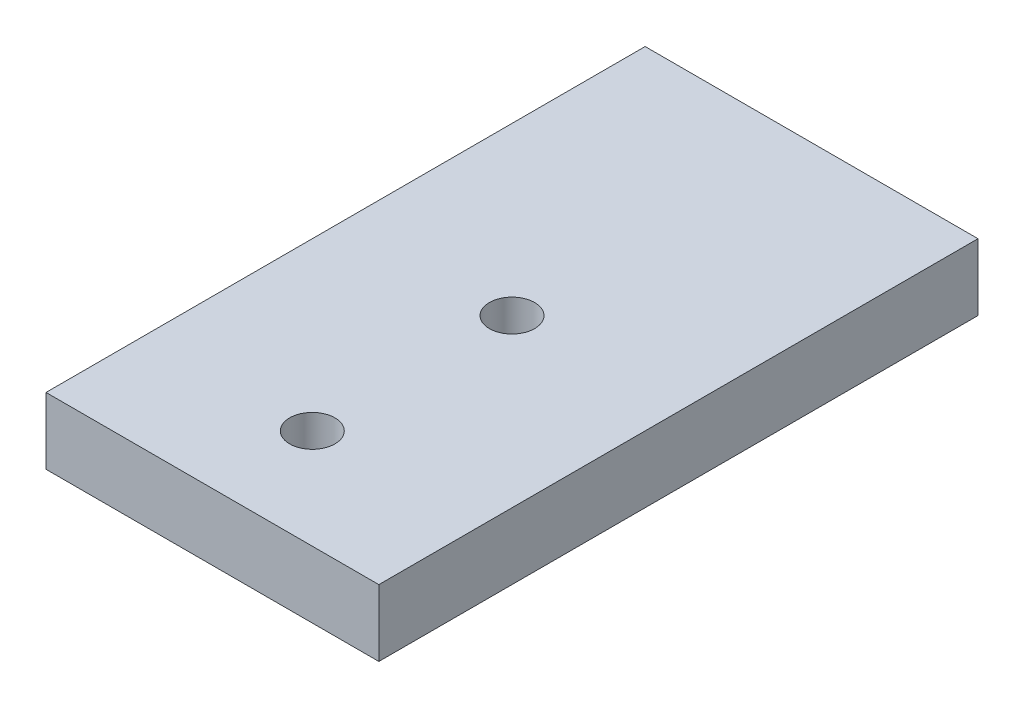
ISO-10303-21;
HEADER;
FILE_DESCRIPTION(('STEP AP214'),'2;1');
FILE_NAME('part.step','',(''),(''),'','','');
FILE_SCHEMA(('AUTOMOTIVE_DESIGN { 1 0 10303 214 1 1 1 1 }'));
ENDSEC;
DATA;
#1=APPLICATION_CONTEXT('core data for automotive mechanical design processes');
#2=APPLICATION_PROTOCOL_DEFINITION('international standard','automotive_design',2000,#1);
#3=PRODUCT_CONTEXT('',#1,'mechanical');
#4=PRODUCT('Part','Part','',(#3));
#5=PRODUCT_RELATED_PRODUCT_CATEGORY('part','',(#4));
#6=PRODUCT_DEFINITION_FORMATION('','',#4);
#7=PRODUCT_DEFINITION_CONTEXT('part definition',#1,'design');
#8=PRODUCT_DEFINITION('design','',#6,#7);
#9=PRODUCT_DEFINITION_SHAPE('','',#8);
#10=(LENGTH_UNIT() NAMED_UNIT(*) SI_UNIT(.MILLI.,.METRE.));
#11=(NAMED_UNIT(*) PLANE_ANGLE_UNIT() SI_UNIT($,.RADIAN.));
#12=(NAMED_UNIT(*) SI_UNIT($,.STERADIAN.) SOLID_ANGLE_UNIT());
#13=UNCERTAINTY_MEASURE_WITH_UNIT(LENGTH_MEASURE(1.E-05),#10,'distance_accuracy_value','');
#14=(GEOMETRIC_REPRESENTATION_CONTEXT(3) GLOBAL_UNCERTAINTY_ASSIGNED_CONTEXT((#13)) GLOBAL_UNIT_ASSIGNED_CONTEXT((#10,
#11,#12)) REPRESENTATION_CONTEXT('',''));
#15=CARTESIAN_POINT('',(0.,0.,0.));
#16=DIRECTION('',(0.,0.,1.));
#17=DIRECTION('',(1.,0.,0.));
#18=AXIS2_PLACEMENT_3D('',#15,#16,#17);
#19=CARTESIAN_POINT('',(0.,10.,45.));
#20=DIRECTION('',(1.,0.,0.));
#21=DIRECTION('',(0.,1.,0.));
#22=AXIS2_PLACEMENT_3D('',#19,#20,#21);
#23=PLANE('',#22);
#24=DIRECTION('',(0.,-1.,0.));
#25=VECTOR('',#24,1.);
#26=CARTESIAN_POINT('',(0.,10.,-45.));
#27=LINE('',#26,#25);
#28=CARTESIAN_POINT('',(0.,10.,-45.));
#29=VERTEX_POINT('',#28);
#30=CARTESIAN_POINT('',(0.,0.,-45.));
#31=VERTEX_POINT('',#30);
#32=EDGE_CURVE('E88',#29,#31,#27,.T.);
#33=ORIENTED_EDGE('',*,*,#32,.T.);
#34=DIRECTION('',(0.,0.,-1.));
#35=VECTOR('',#34,1.);
#36=CARTESIAN_POINT('',(0.,0.,45.));
#37=LINE('',#36,#35);
#38=CARTESIAN_POINT('',(0.,0.,45.));
#39=VERTEX_POINT('',#38);
#40=EDGE_CURVE('E11',#39,#31,#37,.T.);
#41=ORIENTED_EDGE('',*,*,#40,.F.);
#42=DIRECTION('',(0.,-1.,0.));
#43=VECTOR('',#42,1.);
#44=CARTESIAN_POINT('',(0.,10.,45.));
#45=LINE('',#44,#43);
#46=CARTESIAN_POINT('',(0.,10.,45.));
#47=VERTEX_POINT('',#46);
#48=EDGE_CURVE('E117',#47,#39,#45,.T.);
#49=ORIENTED_EDGE('',*,*,#48,.F.);
#50=DIRECTION('',(0.,0.,-1.));
#51=VECTOR('',#50,1.);
#52=CARTESIAN_POINT('',(0.,10.,45.));
#53=LINE('',#52,#51);
#54=EDGE_CURVE('E101',#47,#29,#53,.T.);
#55=ORIENTED_EDGE('',*,*,#54,.T.);
#56=EDGE_LOOP('',(#33,#41,#49,#55));
#57=FACE_BOUND('',#56,.T.);
#58=ADVANCED_FACE('F42',(#57),#23,.F.);
#59=CARTESIAN_POINT('',(0.,0.,45.));
#60=DIRECTION('',(0.,1.,0.));
#61=DIRECTION('',(0.,0.,1.));
#62=AXIS2_PLACEMENT_3D('',#59,#60,#61);
#63=PLANE('',#62);
#64=CARTESIAN_POINT('',(25.,0.,30.));
#65=DIRECTION('',(0.,1.,0.));
#66=DIRECTION('',(0.,0.,1.));
#67=AXIS2_PLACEMENT_3D('',#64,#65,#66);
#68=CIRCLE('',#67,3.39999999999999);
#69=CARTESIAN_POINT('',(25.,0.,33.4));
#70=VERTEX_POINT('',#69);
#71=EDGE_CURVE('E158',#70,#70,#68,.T.);
#72=ORIENTED_EDGE('',*,*,#71,.T.);
#73=EDGE_LOOP('',(#72));
#74=FACE_BOUND('',#73,.T.);
#75=CARTESIAN_POINT('',(25.,0.,0.));
#76=DIRECTION('',(0.,1.,0.));
#77=DIRECTION('',(0.,0.,1.));
#78=AXIS2_PLACEMENT_3D('',#75,#76,#77);
#79=CIRCLE('',#78,3.39999999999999);
#80=CARTESIAN_POINT('',(25.,0.,3.39999999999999));
#81=VERTEX_POINT('',#80);
#82=EDGE_CURVE('E45',#81,#81,#79,.T.);
#83=ORIENTED_EDGE('',*,*,#82,.T.);
#84=EDGE_LOOP('',(#83));
#85=FACE_BOUND('',#84,.T.);
#86=DIRECTION('',(1.,0.,0.));
#87=VECTOR('',#86,1.);
#88=CARTESIAN_POINT('',(0.,0.,-45.));
#89=LINE('',#88,#87);
#90=CARTESIAN_POINT('',(50.,0.,-45.));
#91=VERTEX_POINT('',#90);
#92=EDGE_CURVE('E84',#31,#91,#89,.T.);
#93=ORIENTED_EDGE('',*,*,#92,.T.);
#94=DIRECTION('',(0.,0.,-1.));
#95=VECTOR('',#94,1.);
#96=CARTESIAN_POINT('',(50.,0.,45.));
#97=LINE('',#96,#95);
#98=CARTESIAN_POINT('',(50.,0.,45.));
#99=VERTEX_POINT('',#98);
#100=EDGE_CURVE('E51',#99,#91,#97,.T.);
#101=ORIENTED_EDGE('',*,*,#100,.F.);
#102=DIRECTION('',(1.,0.,0.));
#103=VECTOR('',#102,1.);
#104=CARTESIAN_POINT('',(0.,0.,45.));
#105=LINE('',#104,#103);
#106=EDGE_CURVE('E97',#39,#99,#105,.T.);
#107=ORIENTED_EDGE('',*,*,#106,.F.);
#108=ORIENTED_EDGE('',*,*,#40,.T.);
#109=EDGE_LOOP('',(#93,#101,#107,#108));
#110=FACE_BOUND('',#109,.T.);
#111=ADVANCED_FACE('F96',(#74,#85,#110),#63,.F.);
#112=CARTESIAN_POINT('',(50.,10.,45.));
#113=DIRECTION('',(-1.,0.,0.));
#114=DIRECTION('',(0.,0.,1.));
#115=AXIS2_PLACEMENT_3D('',#112,#113,#114);
#116=PLANE('',#115);
#117=DIRECTION('',(0.,1.,0.));
#118=VECTOR('',#117,1.);
#119=CARTESIAN_POINT('',(50.,10.,-45.));
#120=LINE('',#119,#118);
#121=CARTESIAN_POINT('',(50.,10.,-45.));
#122=VERTEX_POINT('',#121);
#123=EDGE_CURVE('E89',#91,#122,#120,.T.);
#124=ORIENTED_EDGE('',*,*,#123,.T.);
#125=DIRECTION('',(0.,0.,-1.));
#126=VECTOR('',#125,1.);
#127=CARTESIAN_POINT('',(50.,10.,45.));
#128=LINE('',#127,#126);
#129=CARTESIAN_POINT('',(50.,10.,45.));
#130=VERTEX_POINT('',#129);
#131=EDGE_CURVE('E127',#130,#122,#128,.T.);
#132=ORIENTED_EDGE('',*,*,#131,.F.);
#133=DIRECTION('',(0.,1.,0.));
#134=VECTOR('',#133,1.);
#135=CARTESIAN_POINT('',(50.,10.,45.));
#136=LINE('',#135,#134);
#137=EDGE_CURVE('E63',#99,#130,#136,.T.);
#138=ORIENTED_EDGE('',*,*,#137,.F.);
#139=ORIENTED_EDGE('',*,*,#100,.T.);
#140=EDGE_LOOP('',(#124,#132,#138,#139));
#141=FACE_BOUND('',#140,.T.);
#142=ADVANCED_FACE('F132',(#141),#116,.F.);
#143=CARTESIAN_POINT('',(0.,10.,45.));
#144=DIRECTION('',(0.,-1.,0.));
#145=DIRECTION('',(0.,0.,-1.));
#146=AXIS2_PLACEMENT_3D('',#143,#144,#145);
#147=PLANE('',#146);
#148=CARTESIAN_POINT('',(25.,10.,30.));
#149=DIRECTION('',(0.,1.,0.));
#150=DIRECTION('',(0.,0.,1.));
#151=AXIS2_PLACEMENT_3D('',#148,#149,#150);
#152=CIRCLE('',#151,3.39999999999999);
#153=CARTESIAN_POINT('',(25.,10.,33.4));
#154=VERTEX_POINT('',#153);
#155=EDGE_CURVE('E175',#154,#154,#152,.T.);
#156=ORIENTED_EDGE('',*,*,#155,.F.);
#157=EDGE_LOOP('',(#156));
#158=FACE_BOUND('',#157,.T.);
#159=CARTESIAN_POINT('',(25.,10.,0.));
#160=DIRECTION('',(0.,1.,0.));
#161=DIRECTION('',(0.,0.,1.));
#162=AXIS2_PLACEMENT_3D('',#159,#160,#161);
#163=CIRCLE('',#162,3.39999999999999);
#164=CARTESIAN_POINT('',(25.,10.,3.39999999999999));
#165=VERTEX_POINT('',#164);
#166=EDGE_CURVE('E108',#165,#165,#163,.T.);
#167=ORIENTED_EDGE('',*,*,#166,.F.);
#168=EDGE_LOOP('',(#167));
#169=FACE_BOUND('',#168,.T.);
#170=DIRECTION('',(-1.,0.,0.));
#171=VECTOR('',#170,1.);
#172=CARTESIAN_POINT('',(0.,10.,-45.));
#173=LINE('',#172,#171);
#174=EDGE_CURVE('E114',#122,#29,#173,.T.);
#175=ORIENTED_EDGE('',*,*,#174,.T.);
#176=ORIENTED_EDGE('',*,*,#54,.F.);
#177=DIRECTION('',(-1.,0.,0.));
#178=VECTOR('',#177,1.);
#179=CARTESIAN_POINT('',(0.,10.,45.));
#180=LINE('',#179,#178);
#181=EDGE_CURVE('E58',#130,#47,#180,.T.);
#182=ORIENTED_EDGE('',*,*,#181,.F.);
#183=ORIENTED_EDGE('',*,*,#131,.T.);
#184=EDGE_LOOP('',(#175,#176,#182,#183));
#185=FACE_BOUND('',#184,.T.);
#186=ADVANCED_FACE('F134',(#158,#169,#185),#147,.F.);
#187=CARTESIAN_POINT('',(0.,0.,45.));
#188=DIRECTION('',(0.,0.,1.));
#189=DIRECTION('',(1.,0.,0.));
#190=AXIS2_PLACEMENT_3D('',#187,#188,#189);
#191=PLANE('',#190);
#192=ORIENTED_EDGE('',*,*,#48,.T.);
#193=ORIENTED_EDGE('',*,*,#106,.T.);
#194=ORIENTED_EDGE('',*,*,#137,.T.);
#195=ORIENTED_EDGE('',*,*,#181,.T.);
#196=EDGE_LOOP('',(#192,#193,#194,#195));
#197=FACE_BOUND('',#196,.T.);
#198=ADVANCED_FACE('F135',(#197),#191,.T.);
#199=CARTESIAN_POINT('',(0.,0.,-45.));
#200=DIRECTION('',(0.,0.,1.));
#201=DIRECTION('',(1.,0.,0.));
#202=AXIS2_PLACEMENT_3D('',#199,#200,#201);
#203=PLANE('',#202);
#204=ORIENTED_EDGE('',*,*,#32,.F.);
#205=ORIENTED_EDGE('',*,*,#174,.F.);
#206=ORIENTED_EDGE('',*,*,#123,.F.);
#207=ORIENTED_EDGE('',*,*,#92,.F.);
#208=EDGE_LOOP('',(#204,#205,#206,#207));
#209=FACE_BOUND('',#208,.T.);
#210=ADVANCED_FACE('F85',(#209),#203,.F.);
#211=CARTESIAN_POINT('',(25.,10.,0.));
#212=DIRECTION('',(0.,1.,0.));
#213=DIRECTION('',(0.,0.,1.));
#214=AXIS2_PLACEMENT_3D('',#211,#212,#213);
#215=CYLINDRICAL_SURFACE('',#214,3.39999999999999);
#216=ORIENTED_EDGE('',*,*,#166,.T.);
#217=EDGE_LOOP('',(#216));
#218=FACE_BOUND('',#217,.T.);
#219=ORIENTED_EDGE('',*,*,#82,.F.);
#220=EDGE_LOOP('',(#219));
#221=FACE_BOUND('',#220,.T.);
#222=ADVANCED_FACE('F142',(#218,#221),#215,.F.);
#223=CARTESIAN_POINT('',(25.,10.,30.));
#224=DIRECTION('',(0.,1.,0.));
#225=DIRECTION('',(0.,0.,1.));
#226=AXIS2_PLACEMENT_3D('',#223,#224,#225);
#227=CYLINDRICAL_SURFACE('',#226,3.39999999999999);
#228=ORIENTED_EDGE('',*,*,#155,.T.);
#229=EDGE_LOOP('',(#228));
#230=FACE_BOUND('',#229,.T.);
#231=ORIENTED_EDGE('',*,*,#71,.F.);
#232=EDGE_LOOP('',(#231));
#233=FACE_BOUND('',#232,.T.);
#234=ADVANCED_FACE('F162',(#230,#233),#227,.F.);
#235=CLOSED_SHELL('',(#58,#111,#142,#186,#198,#210,#222,#234));
#236=MANIFOLD_SOLID_BREP('B2',#235);
#237=ADVANCED_BREP_SHAPE_REPRESENTATION('',(#18,#236),#14);
#238=SHAPE_DEFINITION_REPRESENTATION(#9,#237);
ENDSEC;
END-ISO-10303-21;
